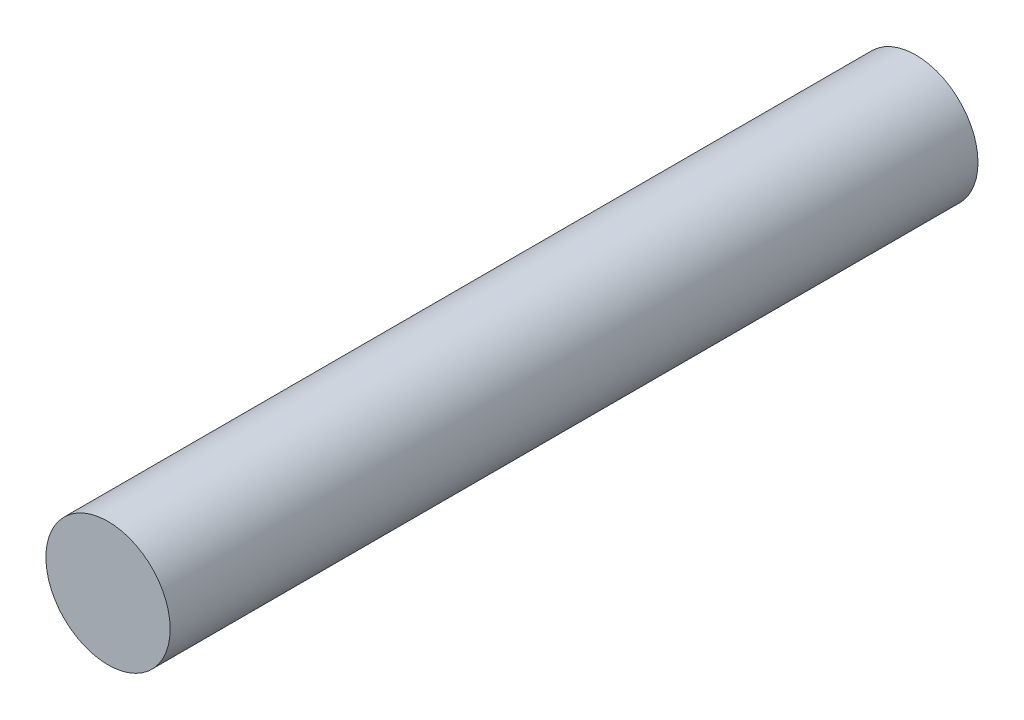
ISO-10303-21;
HEADER;
FILE_DESCRIPTION(('STEP AP214'),'2;1');
FILE_NAME('part.step','',(''),(''),'','','');
FILE_SCHEMA(('AUTOMOTIVE_DESIGN { 1 0 10303 214 1 1 1 1 }'));
ENDSEC;
DATA;
#1=APPLICATION_CONTEXT('core data for automotive mechanical design processes');
#2=APPLICATION_PROTOCOL_DEFINITION('international standard','automotive_design',2000,#1);
#3=PRODUCT_CONTEXT('',#1,'mechanical');
#4=PRODUCT('Part','Part','',(#3));
#5=PRODUCT_RELATED_PRODUCT_CATEGORY('part','',(#4));
#6=PRODUCT_DEFINITION_FORMATION('','',#4);
#7=PRODUCT_DEFINITION_CONTEXT('part definition',#1,'design');
#8=PRODUCT_DEFINITION('design','',#6,#7);
#9=PRODUCT_DEFINITION_SHAPE('','',#8);
#10=(LENGTH_UNIT() NAMED_UNIT(*) SI_UNIT(.MILLI.,.METRE.));
#11=(NAMED_UNIT(*) PLANE_ANGLE_UNIT() SI_UNIT($,.RADIAN.));
#12=(NAMED_UNIT(*) SI_UNIT($,.STERADIAN.) SOLID_ANGLE_UNIT());
#13=UNCERTAINTY_MEASURE_WITH_UNIT(LENGTH_MEASURE(1.E-05),#10,'distance_accuracy_value','');
#14=(GEOMETRIC_REPRESENTATION_CONTEXT(3) GLOBAL_UNCERTAINTY_ASSIGNED_CONTEXT((#13)) GLOBAL_UNIT_ASSIGNED_CONTEXT((#10,
#11,#12)) REPRESENTATION_CONTEXT('',''));
#15=CARTESIAN_POINT('',(0.,0.,0.));
#16=DIRECTION('',(0.,0.,1.));
#17=DIRECTION('',(1.,0.,0.));
#18=AXIS2_PLACEMENT_3D('',#15,#16,#17);
#19=CARTESIAN_POINT('',(0.,0.,4.58329027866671));
#20=DIRECTION('',(0.,0.,1.));
#21=DIRECTION('',(1.,0.,0.));
#22=AXIS2_PLACEMENT_3D('',#19,#20,#21);
#23=CYLINDRICAL_SURFACE('',#22,2.5);
#24=CARTESIAN_POINT('',(0.,0.,0.));
#25=DIRECTION('',(0.,0.,1.));
#26=DIRECTION('',(1.,0.,0.));
#27=AXIS2_PLACEMENT_3D('',#24,#25,#26);
#28=CIRCLE('',#27,2.5);
#29=CARTESIAN_POINT('',(2.5,0.,0.));
#30=VERTEX_POINT('',#29);
#31=EDGE_CURVE('E10',#30,#30,#28,.T.);
#32=ORIENTED_EDGE('',*,*,#31,.T.);
#33=EDGE_LOOP('',(#32));
#34=FACE_BOUND('',#33,.T.);
#35=CARTESIAN_POINT('',(0.,0.,32.5));
#36=DIRECTION('',(0.,0.,1.));
#37=DIRECTION('',(1.,0.,0.));
#38=AXIS2_PLACEMENT_3D('',#35,#36,#37);
#39=CIRCLE('',#38,2.5);
#40=CARTESIAN_POINT('',(2.5,0.,32.5));
#41=VERTEX_POINT('',#40);
#42=EDGE_CURVE('E44',#41,#41,#39,.T.);
#43=ORIENTED_EDGE('',*,*,#42,.F.);
#44=EDGE_LOOP('',(#43));
#45=FACE_BOUND('',#44,.T.);
#46=ADVANCED_FACE('F37',(#34,#45),#23,.T.);
#47=CARTESIAN_POINT('',(2.5,0.,0.));
#48=DIRECTION('',(0.,0.,-1.));
#49=DIRECTION('',(-1.,0.,0.));
#50=AXIS2_PLACEMENT_3D('',#47,#48,#49);
#51=PLANE('',#50);
#52=ORIENTED_EDGE('',*,*,#31,.F.);
#53=EDGE_LOOP('',(#52));
#54=FACE_BOUND('',#53,.T.);
#55=ADVANCED_FACE('F56',(#54),#51,.T.);
#56=CARTESIAN_POINT('',(0.,0.,32.5));
#57=DIRECTION('',(0.,0.,1.));
#58=DIRECTION('',(1.,0.,0.));
#59=AXIS2_PLACEMENT_3D('',#56,#57,#58);
#60=PLANE('',#59);
#61=ORIENTED_EDGE('',*,*,#42,.T.);
#62=EDGE_LOOP('',(#61));
#63=FACE_BOUND('',#62,.T.);
#64=ADVANCED_FACE('F53',(#63),#60,.T.);
#65=CLOSED_SHELL('',(#46,#55,#64));
#66=MANIFOLD_SOLID_BREP('B2',#65);
#67=ADVANCED_BREP_SHAPE_REPRESENTATION('',(#18,#66),#14);
#68=SHAPE_DEFINITION_REPRESENTATION(#9,#67);
ENDSEC;
END-ISO-10303-21;
